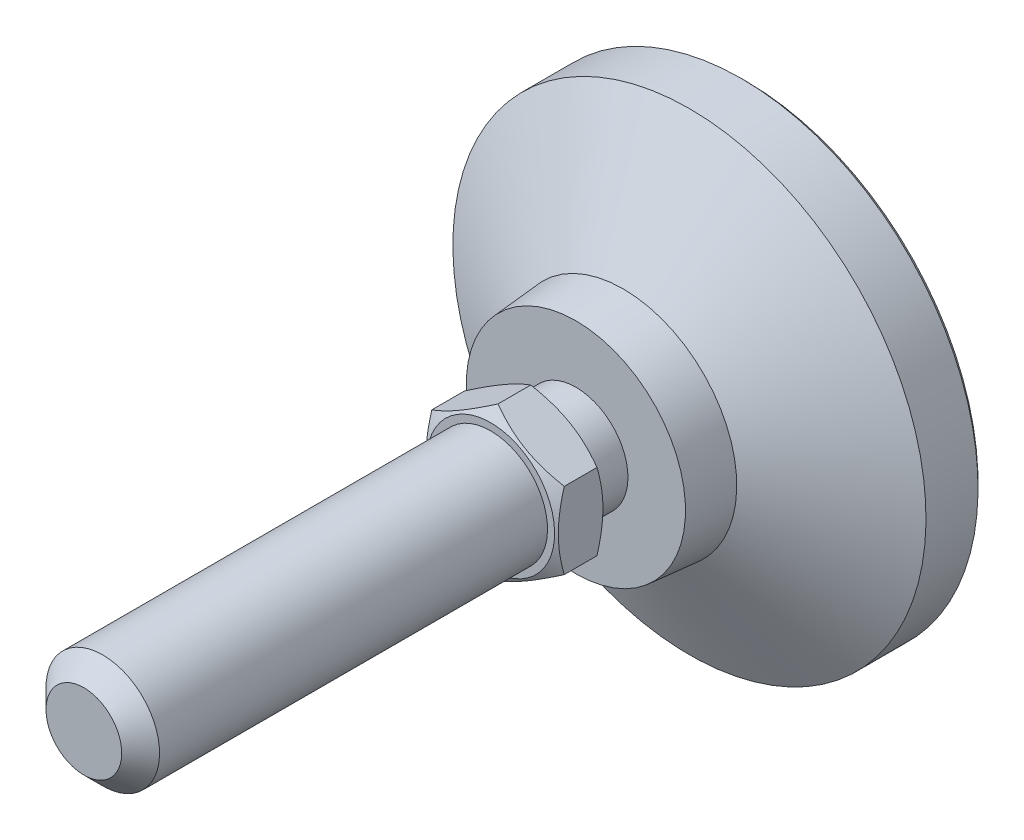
ISO-10303-21;
HEADER;
FILE_DESCRIPTION(('STEP AP214'),'2;1');
FILE_NAME('part.step','',(''),(''),'','','');
FILE_SCHEMA(('AUTOMOTIVE_DESIGN { 1 0 10303 214 1 1 1 1 }'));
ENDSEC;
DATA;
#1=APPLICATION_CONTEXT('core data for automotive mechanical design processes');
#2=APPLICATION_PROTOCOL_DEFINITION('international standard','automotive_design',2000,#1);
#3=PRODUCT_CONTEXT('',#1,'mechanical');
#4=PRODUCT('Part','Part','',(#3));
#5=PRODUCT_RELATED_PRODUCT_CATEGORY('part','',(#4));
#6=PRODUCT_DEFINITION_FORMATION('','',#4);
#7=PRODUCT_DEFINITION_CONTEXT('part definition',#1,'design');
#8=PRODUCT_DEFINITION('design','',#6,#7);
#9=PRODUCT_DEFINITION_SHAPE('','',#8);
#10=(LENGTH_UNIT() NAMED_UNIT(*) SI_UNIT(.MILLI.,.METRE.));
#11=(NAMED_UNIT(*) PLANE_ANGLE_UNIT() SI_UNIT($,.RADIAN.));
#12=(NAMED_UNIT(*) SI_UNIT($,.STERADIAN.) SOLID_ANGLE_UNIT());
#13=UNCERTAINTY_MEASURE_WITH_UNIT(LENGTH_MEASURE(1.E-05),#10,'distance_accuracy_value','');
#14=(GEOMETRIC_REPRESENTATION_CONTEXT(3) GLOBAL_UNCERTAINTY_ASSIGNED_CONTEXT((#13)) GLOBAL_UNIT_ASSIGNED_CONTEXT((#10,
#11,#12)) REPRESENTATION_CONTEXT('',''));
#15=CARTESIAN_POINT('',(0.,0.,0.));
#16=DIRECTION('',(0.,0.,1.));
#17=DIRECTION('',(1.,0.,0.));
#18=AXIS2_PLACEMENT_3D('',#15,#16,#17);
#19=CARTESIAN_POINT('',(0.,0.,-1.00000000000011));
#20=DIRECTION('',(0.,0.,-1.));
#21=DIRECTION('',(0.,1.,0.));
#22=AXIS2_PLACEMENT_3D('',#19,#20,#21);
#23=CYLINDRICAL_SURFACE('',#22,5.5);
#24=CARTESIAN_POINT('',(0.,0.,21.9999999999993));
#25=DIRECTION('',(0.,0.,-1.));
#26=DIRECTION('',(0.,1.,0.));
#27=AXIS2_PLACEMENT_3D('',#24,#25,#26);
#28=CIRCLE('',#27,5.5);
#29=CARTESIAN_POINT('',(0.,5.5,21.9999999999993));
#30=VERTEX_POINT('',#29);
#31=EDGE_CURVE('E106',#30,#30,#28,.T.);
#32=ORIENTED_EDGE('',*,*,#31,.T.);
#33=EDGE_LOOP('',(#32));
#34=FACE_BOUND('',#33,.T.);
#35=CARTESIAN_POINT('',(0.,0.,18.));
#36=DIRECTION('',(0.,0.,-1.));
#37=DIRECTION('',(0.,1.,0.));
#38=AXIS2_PLACEMENT_3D('',#35,#36,#37);
#39=CIRCLE('',#38,5.5);
#40=CARTESIAN_POINT('',(0.,5.5,18.));
#41=VERTEX_POINT('',#40);
#42=EDGE_CURVE('E93',#41,#41,#39,.T.);
#43=ORIENTED_EDGE('',*,*,#42,.F.);
#44=EDGE_LOOP('',(#43));
#45=FACE_BOUND('',#44,.T.);
#46=ADVANCED_FACE('F14',(#34,#45),#23,.T.);
#47=CARTESIAN_POINT('',(-5.5,0.,21.9999999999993));
#48=DIRECTION('',(0.,0.,1.));
#49=DIRECTION('',(0.,-1.,0.));
#50=AXIS2_PLACEMENT_3D('',#47,#48,#49);
#51=PLANE('',#50);
#52=CARTESIAN_POINT('',(0.,0.,21.9999999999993));
#53=DIRECTION('',(0.,0.,1.));
#54=DIRECTION('',(0.,-1.,0.));
#55=AXIS2_PLACEMENT_3D('',#52,#53,#54);
#56=CIRCLE('',#55,6.75);
#57=CARTESIAN_POINT('',(0.,-6.75,21.9999999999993));
#58=VERTEX_POINT('',#57);
#59=EDGE_CURVE('E416',#58,#58,#56,.T.);
#60=ORIENTED_EDGE('',*,*,#59,.F.);
#61=EDGE_LOOP('',(#60));
#62=FACE_BOUND('',#61,.T.);
#63=ORIENTED_EDGE('',*,*,#31,.F.);
#64=EDGE_LOOP('',(#63));
#65=FACE_BOUND('',#64,.T.);
#66=ADVANCED_FACE('F139',(#62,#65),#51,.F.);
#67=CARTESIAN_POINT('',(0.,-5.5,18.));
#68=DIRECTION('',(0.,0.,1.));
#69=DIRECTION('',(0.,-1.,0.));
#70=AXIS2_PLACEMENT_3D('',#67,#68,#69);
#71=PLANE('',#70);
#72=ORIENTED_EDGE('',*,*,#42,.T.);
#73=EDGE_LOOP('',(#72));
#74=FACE_BOUND('',#73,.T.);
#75=CARTESIAN_POINT('',(0.,0.,18.));
#76=DIRECTION('',(0.,0.,1.));
#77=DIRECTION('',(0.,-1.,0.));
#78=AXIS2_PLACEMENT_3D('',#75,#76,#77);
#79=CIRCLE('',#78,11.5833333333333);
#80=CARTESIAN_POINT('',(0.,-11.5833333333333,18.));
#81=VERTEX_POINT('',#80);
#82=EDGE_CURVE('E88',#81,#81,#79,.T.);
#83=ORIENTED_EDGE('',*,*,#82,.T.);
#84=EDGE_LOOP('',(#83));
#85=FACE_BOUND('',#84,.T.);
#86=ADVANCED_FACE('F130',(#74,#85),#71,.T.);
#87=CARTESIAN_POINT('',(0.,0.,0.));
#88=DIRECTION('',(0.,0.,-1.));
#89=DIRECTION('',(0.,1.,0.));
#90=AXIS2_PLACEMENT_3D('',#87,#88,#89);
#91=PLANE('',#90);
#92=CARTESIAN_POINT('',(0.,0.,0.));
#93=DIRECTION('',(0.,0.,-1.));
#94=DIRECTION('',(0.,1.,0.));
#95=AXIS2_PLACEMENT_3D('',#92,#93,#94);
#96=CIRCLE('',#95,24.5);
#97=CARTESIAN_POINT('',(0.,24.5,0.));
#98=VERTEX_POINT('',#97);
#99=EDGE_CURVE('E114',#98,#98,#96,.T.);
#100=ORIENTED_EDGE('',*,*,#99,.T.);
#101=EDGE_LOOP('',(#100));
#102=FACE_BOUND('',#101,.T.);
#103=ADVANCED_FACE('F128',(#102),#91,.T.);
#104=CARTESIAN_POINT('',(0.,0.,-1.00000000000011));
#105=DIRECTION('',(0.,0.,-1.));
#106=DIRECTION('',(0.,1.,0.));
#107=AXIS2_PLACEMENT_3D('',#104,#105,#106);
#108=CYLINDRICAL_SURFACE('',#107,25.);
#109=CARTESIAN_POINT('',(0.,0.,0.500000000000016));
#110=DIRECTION('',(0.,0.,-1.));
#111=DIRECTION('',(0.,1.,0.));
#112=AXIS2_PLACEMENT_3D('',#109,#110,#111);
#113=CIRCLE('',#112,25.);
#114=CARTESIAN_POINT('',(0.,25.,0.500000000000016));
#115=VERTEX_POINT('',#114);
#116=EDGE_CURVE('E28',#115,#115,#113,.F.);
#117=ORIENTED_EDGE('',*,*,#116,.T.);
#118=EDGE_LOOP('',(#117));
#119=FACE_BOUND('',#118,.T.);
#120=CARTESIAN_POINT('',(0.,0.,6.));
#121=DIRECTION('',(0.,0.,-1.));
#122=DIRECTION('',(0.,1.,0.));
#123=AXIS2_PLACEMENT_3D('',#120,#121,#122);
#124=CIRCLE('',#123,25.);
#125=CARTESIAN_POINT('',(0.,25.,6.));
#126=VERTEX_POINT('',#125);
#127=EDGE_CURVE('E112',#126,#126,#124,.T.);
#128=ORIENTED_EDGE('',*,*,#127,.T.);
#129=EDGE_LOOP('',(#128));
#130=FACE_BOUND('',#129,.T.);
#131=ADVANCED_FACE('F120',(#119,#130),#108,.T.);
#132=CARTESIAN_POINT('',(0.,0.,13.));
#133=DIRECTION('',(0.,0.,-1.));
#134=DIRECTION('',(0.,1.,0.));
#135=AXIS2_PLACEMENT_3D('',#132,#133,#134);
#136=CONICAL_SURFACE('',#135,11.9999999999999,1.07685495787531);
#137=ORIENTED_EDGE('',*,*,#127,.F.);
#138=EDGE_LOOP('',(#137));
#139=FACE_BOUND('',#138,.T.);
#140=CARTESIAN_POINT('',(0.,0.,13.));
#141=DIRECTION('',(0.,0.,-1.));
#142=DIRECTION('',(0.,1.,0.));
#143=AXIS2_PLACEMENT_3D('',#140,#141,#142);
#144=CIRCLE('',#143,11.9999999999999);
#145=CARTESIAN_POINT('',(0.,11.9999999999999,13.));
#146=VERTEX_POINT('',#145);
#147=EDGE_CURVE('E109',#146,#146,#144,.T.);
#148=ORIENTED_EDGE('',*,*,#147,.T.);
#149=EDGE_LOOP('',(#148));
#150=FACE_BOUND('',#149,.T.);
#151=ADVANCED_FACE('F138',(#139,#150),#136,.T.);
#152=CARTESIAN_POINT('',(0.,0.,19.));
#153=DIRECTION('',(0.,0.,-1.));
#154=DIRECTION('',(0.,1.,0.));
#155=AXIS2_PLACEMENT_3D('',#152,#153,#154);
#156=CONICAL_SURFACE('',#155,11.5,0.0831412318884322);
#157=ORIENTED_EDGE('',*,*,#147,.F.);
#158=EDGE_LOOP('',(#157));
#159=FACE_BOUND('',#158,.T.);
#160=ORIENTED_EDGE('',*,*,#82,.F.);
#161=EDGE_LOOP('',(#160));
#162=FACE_BOUND('',#161,.T.);
#163=ADVANCED_FACE('F125',(#159,#162),#156,.T.);
#164=CARTESIAN_POINT('',(0.,0.,0.));
#165=DIRECTION('',(0.,0.,1.));
#166=DIRECTION('',(0.,-1.,0.));
#167=AXIS2_PLACEMENT_3D('',#164,#165,#166);
#168=CONICAL_SURFACE('',#167,24.5,0.785398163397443);
#169=ORIENTED_EDGE('',*,*,#116,.F.);
#170=EDGE_LOOP('',(#169));
#171=FACE_BOUND('',#170,.T.);
#172=ORIENTED_EDGE('',*,*,#99,.F.);
#173=EDGE_LOOP('',(#172));
#174=FACE_BOUND('',#173,.T.);
#175=ADVANCED_FACE('F16',(#171,#174),#168,.T.);
#176=CARTESIAN_POINT('',(0.,0.,21.9999999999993));
#177=DIRECTION('',(0.,0.,1.));
#178=DIRECTION('',(0.,-1.,0.));
#179=AXIS2_PLACEMENT_3D('',#176,#177,#178);
#180=CONICAL_SURFACE('',#179,6.75,1.0471975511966);
#181=CARTESIAN_POINT('',(0.000200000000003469,-8.0830192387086,22.7696190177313));
#182=CARTESIAN_POINT('',(-0.15366790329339,-7.99418356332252,22.7183374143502));
#183=CARTESIAN_POINT('',(-0.308109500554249,-7.90501666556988,22.6693831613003));
#184=CARTESIAN_POINT('',(-0.618246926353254,-7.72595873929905,22.5767703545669));
#185=CARTESIAN_POINT('',(-0.773943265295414,-7.63606741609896,22.5331140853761));
#186=CARTESIAN_POINT('',(-1.24352516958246,-7.36495417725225,22.4109491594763));
#187=CARTESIAN_POINT('',(-1.5592643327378,-7.18266208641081,22.3414631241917));
#188=CARTESIAN_POINT('',(-2.03176224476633,-6.90986528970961,22.2599825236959));
#189=CARTESIAN_POINT('',(-2.18710922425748,-6.82017566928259,22.2367710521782));
#190=CARTESIAN_POINT('',(-2.49850511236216,-6.64039116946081,22.1978487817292));
#191=CARTESIAN_POINT('',(-2.65455395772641,-6.55029632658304,22.1821373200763));
#192=CARTESIAN_POINT('',(-2.96692267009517,-6.36995016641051,22.1586154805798));
#193=CARTESIAN_POINT('',(-3.12324202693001,-6.27969914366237,22.1507961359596));
#194=CARTESIAN_POINT('',(-3.43601650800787,-6.09911871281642,22.1432178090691));
#195=CARTESIAN_POINT('',(-3.59247162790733,-6.00878930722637,22.1434585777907));
#196=CARTESIAN_POINT('',(-4.02110687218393,-5.76131663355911,22.1551972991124));
#197=CARTESIAN_POINT('',(-4.2931466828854,-5.60425437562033,22.1749033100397));
#198=CARTESIAN_POINT('',(-4.83541944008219,-5.29117305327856,22.2373910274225));
#199=CARTESIAN_POINT('',(-5.10565047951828,-5.13515508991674,22.2801940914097));
#200=CARTESIAN_POINT('',(-5.64901454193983,-4.82144370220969,22.3871892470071));
#201=CARTESIAN_POINT('',(-5.92207900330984,-4.6637898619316,22.4518346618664));
#202=CARTESIAN_POINT('',(-6.46413578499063,-4.35083323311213,22.5985536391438));
#203=CARTESIAN_POINT('',(-6.73313504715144,-4.19552643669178,22.6805927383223));
#204=CARTESIAN_POINT('',(-7.0002,-4.04133641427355,22.7696190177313));
#205=B_SPLINE_CURVE_WITH_KNOTS('',3,(#181,#182,#183,#184,#185,#186,#187,#188,#189,#190,#191,
#192,#193,#194,#195,#196,#197,#198,#199,#200,#201,#202,#203,#204),.UNSPECIFIED.,.F.,.F.,(4,2,2,
2,2,2,2,2,2,2,2,4),(0.,0.554727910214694,1.10969417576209,2.2219327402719,2.76443041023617,
3.30688013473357,3.8487128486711,4.39052882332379,5.33376515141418,6.27787517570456,
7.24292418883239,8.20607866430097),.UNSPECIFIED.);
#206=CARTESIAN_POINT('',(0.,-8.08290376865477,22.769552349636));
#207=VERTEX_POINT('',#206);
#208=CARTESIAN_POINT('',(-7.,-4.04145188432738,22.769552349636));
#209=VERTEX_POINT('',#208);
#210=EDGE_CURVE('E73',#207,#209,#205,.T.);
#211=ORIENTED_EDGE('',*,*,#210,.T.);
#212=CARTESIAN_POINT('',(-7.,10.8318947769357,25.5489124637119));
#213=CARTESIAN_POINT('',(-7.,10.5263577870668,25.4007960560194));
#214=CARTESIAN_POINT('',(-7.,10.2201168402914,25.2541067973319));
#215=CARTESIAN_POINT('',(-7.,9.60585256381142,24.9643857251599));
#216=CARTESIAN_POINT('',(-7.,9.29782896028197,24.8213544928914));
#217=CARTESIAN_POINT('',(-7.,8.67802637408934,24.5390279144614));
#218=CARTESIAN_POINT('',(-7.,8.36623606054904,24.3997573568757));
#219=CARTESIAN_POINT('',(-7.,7.74016720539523,24.126947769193));
#220=CARTESIAN_POINT('',(-7.,7.42588878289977,23.9934084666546));
#221=CARTESIAN_POINT('',(-7.,6.7842938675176,23.7294406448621));
#222=CARTESIAN_POINT('',(-7.,6.45688057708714,23.599246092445));
#223=CARTESIAN_POINT('',(-7.,5.79821544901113,23.3487686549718));
#224=CARTESIAN_POINT('',(-7.,5.4669631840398,23.228486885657));
#225=CARTESIAN_POINT('',(-7.,4.80071686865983,23.0010105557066));
#226=CARTESIAN_POINT('',(-7.,4.46573203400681,22.8937892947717));
#227=CARTESIAN_POINT('',(-7.,3.79096943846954,22.6958888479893));
#228=CARTESIAN_POINT('',(-7.,3.45119323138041,22.605204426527));
#229=CARTESIAN_POINT('',(-7.,2.76847868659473,22.4452322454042));
#230=CARTESIAN_POINT('',(-7.,2.42556806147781,22.375829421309));
#231=CARTESIAN_POINT('',(-7.,1.90809870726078,22.290703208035));
#232=CARTESIAN_POINT('',(-7.,1.73507880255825,22.265489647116));
#233=CARTESIAN_POINT('',(-7.,1.38818715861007,22.2218836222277));
#234=CARTESIAN_POINT('',(-7.,1.21431550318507,22.2034905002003));
#235=CARTESIAN_POINT('',(-7.,0.868214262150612,22.1741212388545));
#236=CARTESIAN_POINT('',(-7.,0.695992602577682,22.1630520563));
#237=CARTESIAN_POINT('',(-7.,0.35123564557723,22.1482048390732));
#238=CARTESIAN_POINT('',(-7.,0.178700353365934,22.1444266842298));
#239=CARTESIAN_POINT('',(-7.,-0.166375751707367,22.1442515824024));
#240=CARTESIAN_POINT('',(-7.,-0.338916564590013,22.147854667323));
#241=CARTESIAN_POINT('',(-7.,-0.683693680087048,22.1623544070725));
#242=CARTESIAN_POINT('',(-7.,-0.855929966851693,22.1732514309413));
#243=CARTESIAN_POINT('',(-7.,-1.27059309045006,22.2080368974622));
#244=CARTESIAN_POINT('',(-7.,-1.51273234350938,22.2354264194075));
#245=CARTESIAN_POINT('',(-7.,-1.99518655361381,22.3031214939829));
#246=CARTESIAN_POINT('',(-7.,-2.23550125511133,22.3434288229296));
#247=CARTESIAN_POINT('',(-7.,-2.95344894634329,22.4815878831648));
#248=CARTESIAN_POINT('',(-7.,-3.42781219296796,22.596650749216));
#249=CARTESIAN_POINT('',(-7.,-4.13708226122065,22.7958408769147));
#250=CARTESIAN_POINT('',(-7.,-4.37567652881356,22.867590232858));
#251=CARTESIAN_POINT('',(-7.,-4.85054706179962,23.0184566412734));
#252=CARTESIAN_POINT('',(-7.,-5.08682331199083,23.0975737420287));
#253=CARTESIAN_POINT('',(-7.,-5.55713378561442,23.2619132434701));
#254=CARTESIAN_POINT('',(-7.,-5.79116873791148,23.3471335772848));
#255=CARTESIAN_POINT('',(-7.,-6.25730525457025,23.5226852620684));
#256=CARTESIAN_POINT('',(-7.,-6.48940684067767,23.613016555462));
#257=CARTESIAN_POINT('',(-7.,-7.03351444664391,23.8305763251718));
#258=CARTESIAN_POINT('',(-7.,-7.34481113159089,23.959575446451));
#259=CARTESIAN_POINT('',(-7.,-7.96478974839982,24.2237287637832));
#260=CARTESIAN_POINT('',(-7.,-8.27347152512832,24.3588833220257));
#261=CARTESIAN_POINT('',(-7.,-8.88869656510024,24.6341214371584));
#262=CARTESIAN_POINT('',(-7.,-9.19523939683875,24.7742059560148));
#263=CARTESIAN_POINT('',(-7.,-9.80649195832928,25.0583257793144));
#264=CARTESIAN_POINT('',(-7.,-10.111201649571,25.2023611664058));
#265=CARTESIAN_POINT('',(-7.,-10.7193973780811,25.4937961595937));
#266=CARTESIAN_POINT('',(-7.,-11.0228818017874,25.6411991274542));
#267=CARTESIAN_POINT('',(-7.,-11.6285498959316,25.9386560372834));
#268=CARTESIAN_POINT('',(-7.,-11.9307335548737,26.0887100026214));
#269=CARTESIAN_POINT('',(-7.,-12.8355637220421,26.5421094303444));
#270=CARTESIAN_POINT('',(-7.,-13.4365686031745,26.8487306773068));
#271=CARTESIAN_POINT('',(-7.,-14.5856970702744,27.4424566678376));
#272=CARTESIAN_POINT('',(-7.,-15.1340744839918,27.7290723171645));
#273=CARTESIAN_POINT('',(-7.,-16.2287892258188,28.3062159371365));
#274=CARTESIAN_POINT('',(-7.,-16.7751264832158,28.5967440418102));
#275=CARTESIAN_POINT('',(-7.,-17.8648736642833,29.1800697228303));
#276=CARTESIAN_POINT('',(-7.,-18.4082874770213,29.47286004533));
#277=CARTESIAN_POINT('',(-7.,-19.4938087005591,30.0607837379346));
#278=CARTESIAN_POINT('',(-7.,-20.0359161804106,30.3559169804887));
#279=CARTESIAN_POINT('',(-7.,-20.5775418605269,30.6519258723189));
#280=B_SPLINE_CURVE_WITH_KNOTS('',3,(#212,#213,#214,#215,#216,#217,#218,#219,#220,#221,#222,
#223,#224,#225,#226,#227,#228,#229,#230,#231,#232,#233,#234,#235,#236,#237,#238,#239,#240,#241,
#242,#243,#244,#245,#246,#247,#248,#249,#250,#251,#252,#253,#254,#255,#256,#257,#258,#259,#260,
#261,#262,#263,#264,#265,#266,#267,#268,#269,#270,#271,#272,#273,#274,#275,#276,#277,#278,#279),
.UNSPECIFIED.,.F.,.F.,(4,2,2,2,2,2,2,2,2,2,2,2,2,2,2,2,2,2,2,2,2,2,2,2,2,2,2,2,2,2,2,2,2,4),(0.,
1.01864982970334,2.03746051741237,3.06185825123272,4.08620723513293,5.14313083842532,
6.20017324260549,7.25501705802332,8.30952632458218,9.35822927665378,9.8826581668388,
10.4070364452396,10.9246181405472,11.4421913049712,11.959766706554,12.4773682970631,
13.2080051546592,13.938742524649,15.4010372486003,16.1484227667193,16.8958131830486,
17.642951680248,18.3900817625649,19.4008922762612,20.4117623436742,21.4228307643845,
22.4339203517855,23.4460676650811,24.4582239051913,26.4822725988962,28.3385415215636,
30.1948741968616,32.0466841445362,33.8983939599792),.UNSPECIFIED.);
#281=CARTESIAN_POINT('',(-7.,4.04145188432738,22.769552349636));
#282=VERTEX_POINT('',#281);
#283=EDGE_CURVE('E81',#209,#282,#280,.F.);
#284=ORIENTED_EDGE('',*,*,#283,.T.);
#285=CARTESIAN_POINT('',(-7.0002,4.04133641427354,22.7696190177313));
#286=CARTESIAN_POINT('',(-6.84633209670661,4.13017208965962,22.7183374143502));
#287=CARTESIAN_POINT('',(-6.69189049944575,4.21933898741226,22.6693831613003));
#288=CARTESIAN_POINT('',(-6.38175307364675,4.39839691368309,22.5767703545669));
#289=CARTESIAN_POINT('',(-6.22605673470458,4.48828823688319,22.5331140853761));
#290=CARTESIAN_POINT('',(-5.75647483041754,4.75940147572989,22.4109491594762));
#291=CARTESIAN_POINT('',(-5.4407356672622,4.94169356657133,22.3414631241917));
#292=CARTESIAN_POINT('',(-4.96823775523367,5.21449036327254,22.2599825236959));
#293=CARTESIAN_POINT('',(-4.81289077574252,5.30417998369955,22.2367710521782));
#294=CARTESIAN_POINT('',(-4.50149488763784,5.48396448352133,22.1978487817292));
#295=CARTESIAN_POINT('',(-4.34544604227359,5.57405932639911,22.1821373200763));
#296=CARTESIAN_POINT('',(-4.03307732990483,5.75440548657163,22.1586154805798));
#297=CARTESIAN_POINT('',(-3.87675797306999,5.84465650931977,22.1507961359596));
#298=CARTESIAN_POINT('',(-3.56398349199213,6.02523694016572,22.1432178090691));
#299=CARTESIAN_POINT('',(-3.40752837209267,6.11556634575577,22.1434585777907));
#300=CARTESIAN_POINT('',(-2.97889312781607,6.36303901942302,22.1551972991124));
#301=CARTESIAN_POINT('',(-2.7068533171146,6.52010127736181,22.1749033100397));
#302=CARTESIAN_POINT('',(-2.16458055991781,6.83318259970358,22.2373910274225));
#303=CARTESIAN_POINT('',(-1.89434952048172,6.9892005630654,22.2801940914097));
#304=CARTESIAN_POINT('',(-1.35098545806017,7.30291195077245,22.3871892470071));
#305=CARTESIAN_POINT('',(-1.07792099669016,7.46056579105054,22.4518346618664));
#306=CARTESIAN_POINT('',(-0.535864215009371,7.77352241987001,22.5985536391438));
#307=CARTESIAN_POINT('',(-0.26686495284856,7.92882921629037,22.6805927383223));
#308=CARTESIAN_POINT('',(0.000199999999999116,8.0830192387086,22.7696190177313));
#309=B_SPLINE_CURVE_WITH_KNOTS('',3,(#285,#286,#287,#288,#289,#290,#291,#292,#293,#294,#295,
#296,#297,#298,#299,#300,#301,#302,#303,#304,#305,#306,#307,#308),.UNSPECIFIED.,.F.,.F.,(4,2,2,
2,2,2,2,2,2,2,2,4),(0.,0.554727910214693,1.10969417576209,2.2219327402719,2.76443041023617,
3.30688013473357,3.84871284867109,4.39052882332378,5.33376515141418,6.27787517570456,
7.2429241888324,8.20607866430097),.UNSPECIFIED.);
#310=CARTESIAN_POINT('',(0.,8.08290376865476,22.769552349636));
#311=VERTEX_POINT('',#310);
#312=EDGE_CURVE('E367',#282,#311,#309,.T.);
#313=ORIENTED_EDGE('',*,*,#312,.T.);
#314=CARTESIAN_POINT('',(-0.000200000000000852,8.0830192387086,22.7696190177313));
#315=CARTESIAN_POINT('',(0.153667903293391,7.99418356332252,22.7183374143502));
#316=CARTESIAN_POINT('',(0.308109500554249,7.90501666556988,22.6693831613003));
#317=CARTESIAN_POINT('',(0.618246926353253,7.72595873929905,22.5767703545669));
#318=CARTESIAN_POINT('',(0.773943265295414,7.63606741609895,22.5331140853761));
#319=CARTESIAN_POINT('',(1.24352516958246,7.36495417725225,22.4109491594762));
#320=CARTESIAN_POINT('',(1.5592643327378,7.18266208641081,22.3414631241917));
#321=CARTESIAN_POINT('',(2.03176224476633,6.9098652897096,22.2599825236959));
#322=CARTESIAN_POINT('',(2.18710922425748,6.82017566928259,22.2367710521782));
#323=CARTESIAN_POINT('',(2.49850511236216,6.64039116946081,22.1978487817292));
#324=CARTESIAN_POINT('',(2.6545539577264,6.55029632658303,22.1821373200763));
#325=CARTESIAN_POINT('',(2.96692267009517,6.36995016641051,22.1586154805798));
#326=CARTESIAN_POINT('',(3.12324202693,6.27969914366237,22.1507961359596));
#327=CARTESIAN_POINT('',(3.43601650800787,6.09911871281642,22.1432178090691));
#328=CARTESIAN_POINT('',(3.59247162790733,6.00878930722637,22.1434585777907));
#329=CARTESIAN_POINT('',(4.02110687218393,5.76131663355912,22.1551972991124));
#330=CARTESIAN_POINT('',(4.2931466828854,5.60425437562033,22.1749033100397));
#331=CARTESIAN_POINT('',(4.83541944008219,5.29117305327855,22.2373910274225));
#332=CARTESIAN_POINT('',(5.10565047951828,5.13515508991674,22.2801940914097));
#333=CARTESIAN_POINT('',(5.64901454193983,4.82144370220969,22.3871892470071));
#334=CARTESIAN_POINT('',(5.92207900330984,4.66378986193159,22.4518346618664));
#335=CARTESIAN_POINT('',(6.46413578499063,4.35083323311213,22.5985536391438));
#336=CARTESIAN_POINT('',(6.73313504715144,4.19552643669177,22.6805927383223));
#337=CARTESIAN_POINT('',(7.0002,4.04133641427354,22.7696190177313));
#338=B_SPLINE_CURVE_WITH_KNOTS('',3,(#314,#315,#316,#317,#318,#319,#320,#321,#322,#323,#324,
#325,#326,#327,#328,#329,#330,#331,#332,#333,#334,#335,#336,#337),.UNSPECIFIED.,.F.,.F.,(4,2,2,
2,2,2,2,2,2,2,2,4),(0.,0.554727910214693,1.10969417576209,2.2219327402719,2.76443041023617,
3.30688013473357,3.8487128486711,4.39052882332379,5.33376515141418,6.27787517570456,
7.2429241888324,8.20607866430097),.UNSPECIFIED.);
#339=CARTESIAN_POINT('',(7.,4.04145188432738,22.769552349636));
#340=VERTEX_POINT('',#339);
#341=EDGE_CURVE('E362',#311,#340,#338,.T.);
#342=ORIENTED_EDGE('',*,*,#341,.T.);
#343=CARTESIAN_POINT('',(7.,10.8318947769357,25.5489124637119));
#344=CARTESIAN_POINT('',(7.,10.5263577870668,25.4007960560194));
#345=CARTESIAN_POINT('',(7.,10.2201168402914,25.2541067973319));
#346=CARTESIAN_POINT('',(7.,9.60585256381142,24.9643857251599));
#347=CARTESIAN_POINT('',(7.,9.29782896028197,24.8213544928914));
#348=CARTESIAN_POINT('',(7.,8.67802637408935,24.5390279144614));
#349=CARTESIAN_POINT('',(7.,8.36623606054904,24.3997573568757));
#350=CARTESIAN_POINT('',(7.,7.74016720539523,24.126947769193));
#351=CARTESIAN_POINT('',(7.,7.42588878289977,23.9934084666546));
#352=CARTESIAN_POINT('',(7.,6.7842938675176,23.7294406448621));
#353=CARTESIAN_POINT('',(7.,6.45688057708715,23.599246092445));
#354=CARTESIAN_POINT('',(7.,5.79821544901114,23.3487686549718));
#355=CARTESIAN_POINT('',(7.,5.46696318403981,23.228486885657));
#356=CARTESIAN_POINT('',(7.,4.80071686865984,23.0010105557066));
#357=CARTESIAN_POINT('',(7.,4.46573203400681,22.8937892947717));
#358=CARTESIAN_POINT('',(7.,3.79096943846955,22.6958888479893));
#359=CARTESIAN_POINT('',(7.,3.45119323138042,22.605204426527));
#360=CARTESIAN_POINT('',(7.,2.76847868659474,22.4452322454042));
#361=CARTESIAN_POINT('',(7.,2.42556806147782,22.375829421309));
#362=CARTESIAN_POINT('',(7.,1.90809870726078,22.290703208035));
#363=CARTESIAN_POINT('',(7.,1.73507880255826,22.265489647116));
#364=CARTESIAN_POINT('',(7.,1.38818715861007,22.2218836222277));
#365=CARTESIAN_POINT('',(7.,1.21431550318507,22.2034905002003));
#366=CARTESIAN_POINT('',(7.,0.868214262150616,22.1741212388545));
#367=CARTESIAN_POINT('',(7.,0.695992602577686,22.1630520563));
#368=CARTESIAN_POINT('',(7.,0.351235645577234,22.1482048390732));
#369=CARTESIAN_POINT('',(7.,0.178700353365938,22.1444266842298));
#370=CARTESIAN_POINT('',(7.,-0.166375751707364,22.1442515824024));
#371=CARTESIAN_POINT('',(7.,-0.33891656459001,22.147854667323));
#372=CARTESIAN_POINT('',(7.,-0.683693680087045,22.1623544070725));
#373=CARTESIAN_POINT('',(7.,-0.855929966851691,22.1732514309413));
#374=CARTESIAN_POINT('',(7.,-1.27059309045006,22.2080368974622));
#375=CARTESIAN_POINT('',(7.,-1.51273234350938,22.2354264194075));
#376=CARTESIAN_POINT('',(7.,-1.99518655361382,22.3031214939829));
#377=CARTESIAN_POINT('',(7.,-2.23550125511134,22.3434288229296));
#378=CARTESIAN_POINT('',(7.,-2.95344894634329,22.4815878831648));
#379=CARTESIAN_POINT('',(7.,-3.42781219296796,22.596650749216));
#380=CARTESIAN_POINT('',(7.,-4.13708226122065,22.7958408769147));
#381=CARTESIAN_POINT('',(7.,-4.37567652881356,22.867590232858));
#382=CARTESIAN_POINT('',(7.,-4.85054706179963,23.0184566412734));
#383=CARTESIAN_POINT('',(7.,-5.08682331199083,23.0975737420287));
#384=CARTESIAN_POINT('',(7.,-5.55713378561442,23.2619132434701));
#385=CARTESIAN_POINT('',(7.,-5.79116873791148,23.3471335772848));
#386=CARTESIAN_POINT('',(7.,-6.25730525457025,23.5226852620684));
#387=CARTESIAN_POINT('',(7.,-6.48940684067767,23.613016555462));
#388=CARTESIAN_POINT('',(7.,-7.03351444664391,23.8305763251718));
#389=CARTESIAN_POINT('',(7.,-7.34481113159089,23.959575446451));
#390=CARTESIAN_POINT('',(7.,-7.96478974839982,24.2237287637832));
#391=CARTESIAN_POINT('',(7.,-8.27347152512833,24.3588833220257));
#392=CARTESIAN_POINT('',(7.,-8.88869656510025,24.6341214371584));
#393=CARTESIAN_POINT('',(7.,-9.19523939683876,24.7742059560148));
#394=CARTESIAN_POINT('',(7.,-9.80649195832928,25.0583257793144));
#395=CARTESIAN_POINT('',(7.,-10.111201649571,25.2023611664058));
#396=CARTESIAN_POINT('',(7.,-10.7193973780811,25.4937961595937));
#397=CARTESIAN_POINT('',(7.,-11.0228818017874,25.6411991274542));
#398=CARTESIAN_POINT('',(7.,-11.6285498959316,25.9386560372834));
#399=CARTESIAN_POINT('',(7.,-11.9307335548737,26.0887100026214));
#400=CARTESIAN_POINT('',(7.,-12.8355637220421,26.5421094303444));
#401=CARTESIAN_POINT('',(7.,-13.4365686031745,26.8487306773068));
#402=CARTESIAN_POINT('',(7.,-14.5856970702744,27.4424566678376));
#403=CARTESIAN_POINT('',(7.,-15.1340744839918,27.7290723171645));
#404=CARTESIAN_POINT('',(7.,-16.2287892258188,28.3062159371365));
#405=CARTESIAN_POINT('',(7.,-16.7751264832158,28.5967440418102));
#406=CARTESIAN_POINT('',(7.,-17.8648736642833,29.1800697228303));
#407=CARTESIAN_POINT('',(7.,-18.4082874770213,29.47286004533));
#408=CARTESIAN_POINT('',(7.,-19.4938087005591,30.0607837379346));
#409=CARTESIAN_POINT('',(7.,-20.0359161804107,30.3559169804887));
#410=CARTESIAN_POINT('',(7.,-20.5775418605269,30.6519258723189));
#411=B_SPLINE_CURVE_WITH_KNOTS('',3,(#343,#344,#345,#346,#347,#348,#349,#350,#351,#352,#353,
#354,#355,#356,#357,#358,#359,#360,#361,#362,#363,#364,#365,#366,#367,#368,#369,#370,#371,#372,
#373,#374,#375,#376,#377,#378,#379,#380,#381,#382,#383,#384,#385,#386,#387,#388,#389,#390,#391,
#392,#393,#394,#395,#396,#397,#398,#399,#400,#401,#402,#403,#404,#405,#406,#407,#408,#409,#410),
.UNSPECIFIED.,.F.,.F.,(4,2,2,2,2,2,2,2,2,2,2,2,2,2,2,2,2,2,2,2,2,2,2,2,2,2,2,2,2,2,2,2,2,4),(0.,
1.01864982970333,2.03746051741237,3.06185825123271,4.08620723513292,5.14313083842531,
6.20017324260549,7.25501705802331,8.30952632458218,9.35822927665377,9.8826581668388,
10.4070364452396,10.9246181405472,11.4421913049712,11.959766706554,12.4773682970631,
13.2080051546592,13.938742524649,15.4010372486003,16.1484227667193,16.8958131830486,
17.642951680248,18.3900817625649,19.4008922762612,20.4117623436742,21.4228307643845,
22.4339203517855,23.4460676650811,24.4582239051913,26.4822725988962,28.3385415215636,
30.1948741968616,32.0466841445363,33.8983939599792),.UNSPECIFIED.);
#412=CARTESIAN_POINT('',(7.,-4.04145188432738,22.769552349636));
#413=VERTEX_POINT('',#412);
#414=EDGE_CURVE('E34',#340,#413,#411,.T.);
#415=ORIENTED_EDGE('',*,*,#414,.T.);
#416=CARTESIAN_POINT('',(7.0002,-4.04133641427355,22.7696190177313));
#417=CARTESIAN_POINT('',(6.84633209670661,-4.13017208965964,22.7183374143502));
#418=CARTESIAN_POINT('',(6.69189049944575,-4.21933898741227,22.6693831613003));
#419=CARTESIAN_POINT('',(6.38175307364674,-4.3983969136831,22.5767703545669));
#420=CARTESIAN_POINT('',(6.22605673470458,-4.4882882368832,22.5331140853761));
#421=CARTESIAN_POINT('',(5.75647483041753,-4.7594014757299,22.4109491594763));
#422=CARTESIAN_POINT('',(5.4407356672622,-4.94169356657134,22.3414631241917));
#423=CARTESIAN_POINT('',(4.96823775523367,-5.21449036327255,22.2599825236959));
#424=CARTESIAN_POINT('',(4.81289077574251,-5.30417998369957,22.2367710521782));
#425=CARTESIAN_POINT('',(4.50149488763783,-5.48396448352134,22.1978487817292));
#426=CARTESIAN_POINT('',(4.34544604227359,-5.57405932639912,22.1821373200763));
#427=CARTESIAN_POINT('',(4.03307732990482,-5.75440548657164,22.1586154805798));
#428=CARTESIAN_POINT('',(3.87675797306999,-5.84465650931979,22.1507961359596));
#429=CARTESIAN_POINT('',(3.56398349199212,-6.02523694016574,22.1432178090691));
#430=CARTESIAN_POINT('',(3.40752837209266,-6.11556634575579,22.1434585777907));
#431=CARTESIAN_POINT('',(2.97889312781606,-6.36303901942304,22.1551972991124));
#432=CARTESIAN_POINT('',(2.7068533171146,-6.52010127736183,22.1749033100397));
#433=CARTESIAN_POINT('',(2.1645805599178,-6.8331825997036,22.2373910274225));
#434=CARTESIAN_POINT('',(1.89434952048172,-6.98920056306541,22.2801940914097));
#435=CARTESIAN_POINT('',(1.35098545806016,-7.30291195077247,22.3871892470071));
#436=CARTESIAN_POINT('',(1.07792099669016,-7.46056579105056,22.4518346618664));
#437=CARTESIAN_POINT('',(0.535864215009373,-7.77352241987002,22.5985536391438));
#438=CARTESIAN_POINT('',(0.266864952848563,-7.92882921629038,22.6805927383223));
#439=CARTESIAN_POINT('',(-0.000199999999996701,-8.08301923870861,22.7696190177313));
#440=B_SPLINE_CURVE_WITH_KNOTS('',3,(#416,#417,#418,#419,#420,#421,#422,#423,#424,#425,#426,
#427,#428,#429,#430,#431,#432,#433,#434,#435,#436,#437,#438,#439),.UNSPECIFIED.,.F.,.F.,(4,2,2,
2,2,2,2,2,2,2,2,4),(0.,0.554727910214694,1.10969417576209,2.2219327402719,2.76443041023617,
3.30688013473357,3.8487128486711,4.39052882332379,5.33376515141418,6.27787517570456,
7.2429241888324,8.20607866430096),.UNSPECIFIED.);
#441=EDGE_CURVE('E9',#413,#207,#440,.T.);
#442=ORIENTED_EDGE('',*,*,#441,.T.);
#443=EDGE_LOOP('',(#211,#284,#313,#342,#415,#442));
#444=FACE_BOUND('',#443,.T.);
#445=ORIENTED_EDGE('',*,*,#59,.T.);
#446=EDGE_LOOP('',(#445));
#447=FACE_BOUND('',#446,.T.);
#448=ADVANCED_FACE('F71',(#444,#447),#180,.T.);
#449=CARTESIAN_POINT('',(-3.9999999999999,0.,70.));
#450=DIRECTION('',(0.,0.,-1.));
#451=DIRECTION('',(0.,1.,0.));
#452=AXIS2_PLACEMENT_3D('',#449,#450,#451);
#453=PLANE('',#452);
#454=CARTESIAN_POINT('',(0.,0.,70.));
#455=DIRECTION('',(0.,0.,-1.));
#456=DIRECTION('',(0.,1.,0.));
#457=AXIS2_PLACEMENT_3D('',#454,#455,#456);
#458=CIRCLE('',#457,3.9999999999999);
#459=CARTESIAN_POINT('',(0.,3.9999999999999,70.));
#460=VERTEX_POINT('',#459);
#461=EDGE_CURVE('E97',#460,#460,#458,.T.);
#462=ORIENTED_EDGE('',*,*,#461,.F.);
#463=EDGE_LOOP('',(#462));
#464=FACE_BOUND('',#463,.T.);
#465=ADVANCED_FACE('F193',(#464),#453,.F.);
#466=CARTESIAN_POINT('',(0.,0.,70.));
#467=DIRECTION('',(0.,0.,-1.));
#468=DIRECTION('',(0.,1.,0.));
#469=AXIS2_PLACEMENT_3D('',#466,#467,#468);
#470=CONICAL_SURFACE('',#469,3.9999999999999,0.785398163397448);
#471=CARTESIAN_POINT('',(0.,0.,68.));
#472=DIRECTION('',(0.,0.,-1.));
#473=DIRECTION('',(0.,1.,0.));
#474=AXIS2_PLACEMENT_3D('',#471,#472,#473);
#475=CIRCLE('',#474,5.99999999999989);
#476=CARTESIAN_POINT('',(0.,5.99999999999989,68.));
#477=VERTEX_POINT('',#476);
#478=EDGE_CURVE('E100',#477,#477,#475,.T.);
#479=ORIENTED_EDGE('',*,*,#478,.F.);
#480=EDGE_LOOP('',(#479));
#481=FACE_BOUND('',#480,.T.);
#482=ORIENTED_EDGE('',*,*,#461,.T.);
#483=EDGE_LOOP('',(#482));
#484=FACE_BOUND('',#483,.T.);
#485=ADVANCED_FACE('F200',(#481,#484),#470,.T.);
#486=CARTESIAN_POINT('',(0.,0.,-1.00000000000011));
#487=DIRECTION('',(0.,0.,-1.));
#488=DIRECTION('',(0.,1.,0.));
#489=AXIS2_PLACEMENT_3D('',#486,#487,#488);
#490=CYLINDRICAL_SURFACE('',#489,5.99999999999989);
#491=CARTESIAN_POINT('',(0.,0.,26.9999999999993));
#492=DIRECTION('',(0.,0.,-1.));
#493=DIRECTION('',(0.,1.,0.));
#494=AXIS2_PLACEMENT_3D('',#491,#492,#493);
#495=CIRCLE('',#494,5.99999999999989);
#496=CARTESIAN_POINT('',(0.,5.99999999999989,26.9999999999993));
#497=VERTEX_POINT('',#496);
#498=EDGE_CURVE('E103',#497,#497,#495,.T.);
#499=ORIENTED_EDGE('',*,*,#498,.F.);
#500=EDGE_LOOP('',(#499));
#501=FACE_BOUND('',#500,.T.);
#502=ORIENTED_EDGE('',*,*,#478,.T.);
#503=EDGE_LOOP('',(#502));
#504=FACE_BOUND('',#503,.T.);
#505=ADVANCED_FACE('F209',(#501,#504),#490,.T.);
#506=CARTESIAN_POINT('',(-5.99999999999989,0.,26.9999999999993));
#507=DIRECTION('',(0.,0.,-1.));
#508=DIRECTION('',(0.,1.,0.));
#509=AXIS2_PLACEMENT_3D('',#506,#507,#508);
#510=PLANE('',#509);
#511=CARTESIAN_POINT('',(0.,0.,26.9999999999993));
#512=DIRECTION('',(0.,0.,1.));
#513=DIRECTION('',(0.,-1.,0.));
#514=AXIS2_PLACEMENT_3D('',#511,#512,#513);
#515=CIRCLE('',#514,6.75);
#516=CARTESIAN_POINT('',(0.,-6.75,26.9999999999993));
#517=VERTEX_POINT('',#516);
#518=EDGE_CURVE('E80',#517,#517,#515,.T.);
#519=ORIENTED_EDGE('',*,*,#518,.T.);
#520=EDGE_LOOP('',(#519));
#521=FACE_BOUND('',#520,.T.);
#522=ORIENTED_EDGE('',*,*,#498,.T.);
#523=EDGE_LOOP('',(#522));
#524=FACE_BOUND('',#523,.T.);
#525=ADVANCED_FACE('F218',(#521,#524),#510,.F.);
#526=CARTESIAN_POINT('',(0.,0.,25.2717316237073));
#527=DIRECTION('',(0.,0.,-1.));
#528=DIRECTION('',(0.,1.,0.));
#529=AXIS2_PLACEMENT_3D('',#526,#527,#528);
#530=CONICAL_SURFACE('',#529,9.74344863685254,1.0471975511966);
#531=CARTESIAN_POINT('',(-7.0002,-4.04133641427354,26.2303809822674));
#532=CARTESIAN_POINT('',(-6.84633209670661,-4.13017208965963,26.2816625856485));
#533=CARTESIAN_POINT('',(-6.69189049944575,-4.21933898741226,26.3306168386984));
#534=CARTESIAN_POINT('',(-6.38175307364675,-4.39839691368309,26.4232296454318));
#535=CARTESIAN_POINT('',(-6.22605673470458,-4.48828823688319,26.4668859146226));
#536=CARTESIAN_POINT('',(-5.75647483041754,-4.7594014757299,26.5890508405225));
#537=CARTESIAN_POINT('',(-5.4407356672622,-4.94169356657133,26.658536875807));
#538=CARTESIAN_POINT('',(-4.96823775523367,-5.21449036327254,26.7400174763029));
#539=CARTESIAN_POINT('',(-4.81289077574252,-5.30417998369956,26.7632289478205));
#540=CARTESIAN_POINT('',(-4.50149488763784,-5.48396448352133,26.8021512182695));
#541=CARTESIAN_POINT('',(-4.3454460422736,-5.57405932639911,26.8178626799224));
#542=CARTESIAN_POINT('',(-4.03307732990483,-5.75440548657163,26.8413845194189));
#543=CARTESIAN_POINT('',(-3.87675797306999,-5.84465650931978,26.8492038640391));
#544=CARTESIAN_POINT('',(-3.56398349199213,-6.02523694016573,26.8567821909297));
#545=CARTESIAN_POINT('',(-3.40752837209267,-6.11556634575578,26.856541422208));
#546=CARTESIAN_POINT('',(-2.97889312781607,-6.36303901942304,26.8448027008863));
#547=CARTESIAN_POINT('',(-2.7068533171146,-6.52010127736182,26.825096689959));
#548=CARTESIAN_POINT('',(-2.1645805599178,-6.83318259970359,26.7626089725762));
#549=CARTESIAN_POINT('',(-1.89434952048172,-6.98920056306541,26.719805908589));
#550=CARTESIAN_POINT('',(-1.35098545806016,-7.30291195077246,26.6128107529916));
#551=CARTESIAN_POINT('',(-1.07792099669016,-7.46056579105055,26.5481653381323));
#552=CARTESIAN_POINT('',(-0.535864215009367,-7.77352241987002,26.4014463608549));
#553=CARTESIAN_POINT('',(-0.266864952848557,-7.92882921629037,26.3194072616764));
#554=CARTESIAN_POINT('',(0.000200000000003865,-8.0830192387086,26.2303809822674));
#555=B_SPLINE_CURVE_WITH_KNOTS('',3,(#531,#532,#533,#534,#535,#536,#537,#538,#539,#540,#541,
#542,#543,#544,#545,#546,#547,#548,#549,#550,#551,#552,#553,#554),.UNSPECIFIED.,.F.,.F.,(4,2,2,
2,2,2,2,2,2,2,2,4),(0.,0.554727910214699,1.1096941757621,2.2219327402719,2.76443041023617,
3.30688013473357,3.8487128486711,4.39052882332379,5.33376515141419,6.27787517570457,
7.24292418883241,8.20607866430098),.UNSPECIFIED.);
#556=CARTESIAN_POINT('',(-7.,-4.04145188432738,26.2304476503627));
#557=VERTEX_POINT('',#556);
#558=CARTESIAN_POINT('',(0.,-8.08290376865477,26.2304476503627));
#559=VERTEX_POINT('',#558);
#560=EDGE_CURVE('E329',#557,#559,#555,.T.);
#561=ORIENTED_EDGE('',*,*,#560,.T.);
#562=CARTESIAN_POINT('',(-0.000199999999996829,-8.08301923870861,26.2303809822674));
#563=CARTESIAN_POINT('',(0.153667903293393,-7.99418356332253,26.2816625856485));
#564=CARTESIAN_POINT('',(0.308109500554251,-7.90501666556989,26.3306168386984));
#565=CARTESIAN_POINT('',(0.618246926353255,-7.72595873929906,26.4232296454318));
#566=CARTESIAN_POINT('',(0.773943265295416,-7.63606741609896,26.4668859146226));
#567=CARTESIAN_POINT('',(1.24352516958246,-7.36495417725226,26.5890508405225));
#568=CARTESIAN_POINT('',(1.5592643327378,-7.18266208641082,26.658536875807));
#569=CARTESIAN_POINT('',(2.03176224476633,-6.90986528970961,26.7400174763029));
#570=CARTESIAN_POINT('',(2.18710922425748,-6.8201756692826,26.7632289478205));
#571=CARTESIAN_POINT('',(2.49850511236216,-6.64039116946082,26.8021512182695));
#572=CARTESIAN_POINT('',(2.65455395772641,-6.55029632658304,26.8178626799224));
#573=CARTESIAN_POINT('',(2.96692267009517,-6.36995016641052,26.8413845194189));
#574=CARTESIAN_POINT('',(3.12324202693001,-6.27969914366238,26.8492038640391));
#575=CARTESIAN_POINT('',(3.43601650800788,-6.09911871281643,26.8567821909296));
#576=CARTESIAN_POINT('',(3.59247162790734,-6.00878930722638,26.856541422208));
#577=CARTESIAN_POINT('',(4.02110687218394,-5.76131663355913,26.8448027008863));
#578=CARTESIAN_POINT('',(4.2931466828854,-5.60425437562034,26.825096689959));
#579=CARTESIAN_POINT('',(4.8354194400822,-5.29117305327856,26.7626089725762));
#580=CARTESIAN_POINT('',(5.10565047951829,-5.13515508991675,26.719805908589));
#581=CARTESIAN_POINT('',(5.64901454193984,-4.8214437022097,26.6128107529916));
#582=CARTESIAN_POINT('',(5.92207900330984,-4.6637898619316,26.5481653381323));
#583=CARTESIAN_POINT('',(6.46413578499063,-4.35083323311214,26.4014463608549));
#584=CARTESIAN_POINT('',(6.73313504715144,-4.19552643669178,26.3194072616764));
#585=CARTESIAN_POINT('',(7.0002,-4.04133641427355,26.2303809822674));
#586=B_SPLINE_CURVE_WITH_KNOTS('',3,(#562,#563,#564,#565,#566,#567,#568,#569,#570,#571,#572,
#573,#574,#575,#576,#577,#578,#579,#580,#581,#582,#583,#584,#585),.UNSPECIFIED.,.F.,.F.,(4,2,2,
2,2,2,2,2,2,2,2,4),(0.,0.554727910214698,1.10969417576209,2.2219327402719,2.76443041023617,
3.30688013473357,3.8487128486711,4.39052882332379,5.33376515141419,6.27787517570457,
7.2429241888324,8.20607866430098),.UNSPECIFIED.);
#587=CARTESIAN_POINT('',(7.,-4.04145188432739,26.2304476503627));
#588=VERTEX_POINT('',#587);
#589=EDGE_CURVE('E86',#559,#588,#586,.T.);
#590=ORIENTED_EDGE('',*,*,#589,.T.);
#591=CARTESIAN_POINT('',(7.,10.8318947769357,23.4510875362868));
#592=CARTESIAN_POINT('',(7.,10.5263577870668,23.5992039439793));
#593=CARTESIAN_POINT('',(7.,10.2201168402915,23.7458932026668));
#594=CARTESIAN_POINT('',(7.,9.60585256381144,24.0356142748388));
#595=CARTESIAN_POINT('',(7.,9.29782896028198,24.1786455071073));
#596=CARTESIAN_POINT('',(7.,8.67802637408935,24.4609720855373));
#597=CARTESIAN_POINT('',(7.,8.36623606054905,24.600242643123));
#598=CARTESIAN_POINT('',(7.,7.74016720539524,24.8730522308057));
#599=CARTESIAN_POINT('',(7.,7.42588878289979,25.0065915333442));
#600=CARTESIAN_POINT('',(7.,6.78429386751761,25.2705593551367));
#601=CARTESIAN_POINT('',(7.,6.45688057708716,25.4007539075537));
#602=CARTESIAN_POINT('',(7.,5.79821544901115,25.6512313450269));
#603=CARTESIAN_POINT('',(7.,5.46696318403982,25.7715131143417));
#604=CARTESIAN_POINT('',(7.,4.80071686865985,25.9989894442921));
#605=CARTESIAN_POINT('',(7.,4.46573203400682,26.106210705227));
#606=CARTESIAN_POINT('',(7.,3.79096943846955,26.3041111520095));
#607=CARTESIAN_POINT('',(7.,3.45119323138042,26.3947955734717));
#608=CARTESIAN_POINT('',(7.,2.76847868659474,26.5547677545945));
#609=CARTESIAN_POINT('',(7.,2.42556806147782,26.6241705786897));
#610=CARTESIAN_POINT('',(7.,1.90809870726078,26.7092967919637));
#611=CARTESIAN_POINT('',(7.,1.73507880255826,26.7345103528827));
#612=CARTESIAN_POINT('',(7.,1.38818715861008,26.778116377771));
#613=CARTESIAN_POINT('',(7.,1.21431550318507,26.7965094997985));
#614=CARTESIAN_POINT('',(7.,0.868214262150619,26.8258787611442));
#615=CARTESIAN_POINT('',(7.,0.69599260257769,26.8369479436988));
#616=CARTESIAN_POINT('',(7.,0.351235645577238,26.8517951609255));
#617=CARTESIAN_POINT('',(7.,0.178700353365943,26.8555733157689));
#618=CARTESIAN_POINT('',(7.,-0.166375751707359,26.8557484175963));
#619=CARTESIAN_POINT('',(7.,-0.338916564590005,26.8521453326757));
#620=CARTESIAN_POINT('',(7.,-0.683693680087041,26.8376455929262));
#621=CARTESIAN_POINT('',(7.,-0.855929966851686,26.8267485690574));
#622=CARTESIAN_POINT('',(7.,-1.27059309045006,26.7919631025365));
#623=CARTESIAN_POINT('',(7.,-1.51273234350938,26.7645735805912));
#624=CARTESIAN_POINT('',(7.,-1.99518655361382,26.6968785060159));
#625=CARTESIAN_POINT('',(7.,-2.23550125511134,26.6565711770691));
#626=CARTESIAN_POINT('',(7.,-2.9534489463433,26.5184121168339));
#627=CARTESIAN_POINT('',(7.,-3.42781219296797,26.4033492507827));
#628=CARTESIAN_POINT('',(7.,-4.13708226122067,26.2041591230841));
#629=CARTESIAN_POINT('',(7.,-4.37567652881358,26.1324097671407));
#630=CARTESIAN_POINT('',(7.,-4.85054706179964,25.9815433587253));
#631=CARTESIAN_POINT('',(7.,-5.08682331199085,25.9024262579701));
#632=CARTESIAN_POINT('',(7.,-5.55713378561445,25.7380867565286));
#633=CARTESIAN_POINT('',(7.,-5.79116873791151,25.652866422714));
#634=CARTESIAN_POINT('',(7.,-6.25730525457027,25.4773147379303));
#635=CARTESIAN_POINT('',(7.,-6.48940684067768,25.3869834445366));
#636=CARTESIAN_POINT('',(7.,-7.03351444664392,25.1694236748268));
#637=CARTESIAN_POINT('',(7.,-7.34481113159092,25.0404245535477));
#638=CARTESIAN_POINT('',(7.,-7.96478974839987,24.7762712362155));
#639=CARTESIAN_POINT('',(7.,-8.27347152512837,24.641116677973));
#640=CARTESIAN_POINT('',(7.,-8.88869656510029,24.3658785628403));
#641=CARTESIAN_POINT('',(7.,-9.1952393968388,24.2257940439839));
#642=CARTESIAN_POINT('',(7.,-9.80649195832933,23.9416742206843));
#643=CARTESIAN_POINT('',(7.,-10.1112016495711,23.7976388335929));
#644=CARTESIAN_POINT('',(7.,-10.7193973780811,23.506203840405));
#645=CARTESIAN_POINT('',(7.,-11.0228818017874,23.3588008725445));
#646=CARTESIAN_POINT('',(7.,-11.6285498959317,23.0613439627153));
#647=CARTESIAN_POINT('',(7.,-11.9307335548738,22.9112899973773));
#648=CARTESIAN_POINT('',(7.,-12.8355637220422,22.4578905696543));
#649=CARTESIAN_POINT('',(7.,-13.4365686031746,22.1512693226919));
#650=CARTESIAN_POINT('',(7.,-14.5856970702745,21.5575433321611));
#651=CARTESIAN_POINT('',(7.,-15.1340744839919,21.2709276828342));
#652=CARTESIAN_POINT('',(7.,-16.2287892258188,20.6937840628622));
#653=CARTESIAN_POINT('',(7.,-16.7751264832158,20.4032559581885));
#654=CARTESIAN_POINT('',(7.,-17.8648736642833,19.8199302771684));
#655=CARTESIAN_POINT('',(7.,-18.4082874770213,19.5271399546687));
#656=CARTESIAN_POINT('',(7.,-19.4938087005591,18.9392162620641));
#657=CARTESIAN_POINT('',(7.,-20.0359161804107,18.6440830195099));
#658=CARTESIAN_POINT('',(7.,-20.5775418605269,18.3480741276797));
#659=B_SPLINE_CURVE_WITH_KNOTS('',3,(#591,#592,#593,#594,#595,#596,#597,#598,#599,#600,#601,
#602,#603,#604,#605,#606,#607,#608,#609,#610,#611,#612,#613,#614,#615,#616,#617,#618,#619,#620,
#621,#622,#623,#624,#625,#626,#627,#628,#629,#630,#631,#632,#633,#634,#635,#636,#637,#638,#639,
#640,#641,#642,#643,#644,#645,#646,#647,#648,#649,#650,#651,#652,#653,#654,#655,#656,#657,#658),
.UNSPECIFIED.,.F.,.F.,(4,2,2,2,2,2,2,2,2,2,2,2,2,2,2,2,2,2,2,2,2,2,2,2,2,2,2,2,2,2,2,2,2,4),(0.,
1.01864982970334,2.03746051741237,3.06185825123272,4.08620723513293,5.14313083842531,
6.20017324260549,7.25501705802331,8.30952632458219,9.35822927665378,9.88265816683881,
10.4070364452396,10.9246181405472,11.4421913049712,11.959766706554,12.4773682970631,
13.2080051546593,13.9387425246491,15.4010372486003,16.1484227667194,16.8958131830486,
17.6429516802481,18.3900817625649,19.4008922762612,20.4117623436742,21.4228307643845,
22.4339203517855,23.4460676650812,24.4582239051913,26.4822725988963,28.3385415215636,
30.1948741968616,32.0466841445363,33.8983939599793),.UNSPECIFIED.);
#660=CARTESIAN_POINT('',(7.,4.04145188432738,26.2304476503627));
#661=VERTEX_POINT('',#660);
#662=EDGE_CURVE('E407',#588,#661,#659,.F.);
#663=ORIENTED_EDGE('',*,*,#662,.T.);
#664=CARTESIAN_POINT('',(7.0002,4.04133641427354,26.2303809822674));
#665=CARTESIAN_POINT('',(6.84633209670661,4.13017208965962,26.2816625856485));
#666=CARTESIAN_POINT('',(6.69189049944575,4.21933898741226,26.3306168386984));
#667=CARTESIAN_POINT('',(6.38175307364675,4.39839691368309,26.4232296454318));
#668=CARTESIAN_POINT('',(6.22605673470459,4.48828823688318,26.4668859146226));
#669=CARTESIAN_POINT('',(5.75647483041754,4.75940147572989,26.5890508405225));
#670=CARTESIAN_POINT('',(5.4407356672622,4.94169356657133,26.658536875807));
#671=CARTESIAN_POINT('',(4.96823775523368,5.21449036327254,26.7400174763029));
#672=CARTESIAN_POINT('',(4.81289077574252,5.30417998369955,26.7632289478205));
#673=CARTESIAN_POINT('',(4.50149488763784,5.48396448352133,26.8021512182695));
#674=CARTESIAN_POINT('',(4.3454460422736,5.5740593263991,26.8178626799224));
#675=CARTESIAN_POINT('',(4.03307732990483,5.75440548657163,26.8413845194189));
#676=CARTESIAN_POINT('',(3.87675797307,5.84465650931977,26.8492038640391));
#677=CARTESIAN_POINT('',(3.56398349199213,6.02523694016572,26.8567821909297));
#678=CARTESIAN_POINT('',(3.40752837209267,6.11556634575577,26.856541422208));
#679=CARTESIAN_POINT('',(2.97889312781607,6.36303901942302,26.8448027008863));
#680=CARTESIAN_POINT('',(2.7068533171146,6.52010127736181,26.825096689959));
#681=CARTESIAN_POINT('',(2.1645805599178,6.83318259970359,26.7626089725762));
#682=CARTESIAN_POINT('',(1.89434952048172,6.9892005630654,26.719805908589));
#683=CARTESIAN_POINT('',(1.35098545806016,7.30291195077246,26.6128107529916));
#684=CARTESIAN_POINT('',(1.07792099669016,7.46056579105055,26.5481653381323));
#685=CARTESIAN_POINT('',(0.535864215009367,7.77352241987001,26.4014463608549));
#686=CARTESIAN_POINT('',(0.266864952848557,7.92882921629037,26.3194072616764));
#687=CARTESIAN_POINT('',(-0.000200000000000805,8.0830192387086,26.2303809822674));
#688=B_SPLINE_CURVE_WITH_KNOTS('',3,(#664,#665,#666,#667,#668,#669,#670,#671,#672,#673,#674,
#675,#676,#677,#678,#679,#680,#681,#682,#683,#684,#685,#686,#687),.UNSPECIFIED.,.F.,.F.,(4,2,2,
2,2,2,2,2,2,2,2,4),(0.,0.554727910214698,1.10969417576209,2.2219327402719,2.76443041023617,
3.30688013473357,3.8487128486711,4.39052882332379,5.33376515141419,6.27787517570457,
7.24292418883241,8.20607866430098),.UNSPECIFIED.);
#689=CARTESIAN_POINT('',(0.,8.08290376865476,26.2304476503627));
#690=VERTEX_POINT('',#689);
#691=EDGE_CURVE('E385',#661,#690,#688,.T.);
#692=ORIENTED_EDGE('',*,*,#691,.T.);
#693=CARTESIAN_POINT('',(0.000199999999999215,8.0830192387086,26.2303809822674));
#694=CARTESIAN_POINT('',(-0.15366790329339,7.99418356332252,26.2816625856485));
#695=CARTESIAN_POINT('',(-0.308109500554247,7.90501666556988,26.3306168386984));
#696=CARTESIAN_POINT('',(-0.618246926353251,7.72595873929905,26.4232296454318));
#697=CARTESIAN_POINT('',(-0.773943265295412,7.63606741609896,26.4668859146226));
#698=CARTESIAN_POINT('',(-1.24352516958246,7.36495417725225,26.5890508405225));
#699=CARTESIAN_POINT('',(-1.5592643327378,7.18266208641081,26.658536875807));
#700=CARTESIAN_POINT('',(-2.03176224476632,6.9098652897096,26.7400174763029));
#701=CARTESIAN_POINT('',(-2.18710922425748,6.82017566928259,26.7632289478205));
#702=CARTESIAN_POINT('',(-2.49850511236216,6.64039116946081,26.8021512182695));
#703=CARTESIAN_POINT('',(-2.6545539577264,6.55029632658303,26.8178626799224));
#704=CARTESIAN_POINT('',(-2.96692267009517,6.36995016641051,26.8413845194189));
#705=CARTESIAN_POINT('',(-3.12324202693,6.27969914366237,26.8492038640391));
#706=CARTESIAN_POINT('',(-3.43601650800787,6.09911871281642,26.8567821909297));
#707=CARTESIAN_POINT('',(-3.59247162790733,6.00878930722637,26.856541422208));
#708=CARTESIAN_POINT('',(-4.02110687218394,5.76131663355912,26.8448027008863));
#709=CARTESIAN_POINT('',(-4.2931466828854,5.60425437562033,26.825096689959));
#710=CARTESIAN_POINT('',(-4.8354194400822,5.29117305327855,26.7626089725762));
#711=CARTESIAN_POINT('',(-5.10565047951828,5.13515508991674,26.719805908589));
#712=CARTESIAN_POINT('',(-5.64901454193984,4.82144370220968,26.6128107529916));
#713=CARTESIAN_POINT('',(-5.92207900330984,4.66378986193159,26.5481653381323));
#714=CARTESIAN_POINT('',(-6.46413578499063,4.35083323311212,26.4014463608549));
#715=CARTESIAN_POINT('',(-6.73313504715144,4.19552643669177,26.3194072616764));
#716=CARTESIAN_POINT('',(-7.0002,4.04133641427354,26.2303809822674));
#717=B_SPLINE_CURVE_WITH_KNOTS('',3,(#693,#694,#695,#696,#697,#698,#699,#700,#701,#702,#703,
#704,#705,#706,#707,#708,#709,#710,#711,#712,#713,#714,#715,#716),.UNSPECIFIED.,.F.,.F.,(4,2,2,
2,2,2,2,2,2,2,2,4),(0.,0.554727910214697,1.10969417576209,2.2219327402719,2.76443041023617,
3.30688013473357,3.8487128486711,4.39052882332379,5.33376515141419,6.27787517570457,
7.24292418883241,8.20607866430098),.UNSPECIFIED.);
#718=CARTESIAN_POINT('',(-7.,4.04145188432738,26.2304476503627));
#719=VERTEX_POINT('',#718);
#720=EDGE_CURVE('E377',#690,#719,#717,.T.);
#721=ORIENTED_EDGE('',*,*,#720,.T.);
#722=CARTESIAN_POINT('',(-7.,10.8318947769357,23.4510875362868));
#723=CARTESIAN_POINT('',(-7.,10.5263577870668,23.5992039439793));
#724=CARTESIAN_POINT('',(-7.,10.2201168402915,23.7458932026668));
#725=CARTESIAN_POINT('',(-7.,9.60585256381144,24.0356142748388));
#726=CARTESIAN_POINT('',(-7.,9.29782896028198,24.1786455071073));
#727=CARTESIAN_POINT('',(-7.,8.67802637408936,24.4609720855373));
#728=CARTESIAN_POINT('',(-7.,8.36623606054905,24.600242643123));
#729=CARTESIAN_POINT('',(-7.,7.74016720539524,24.8730522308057));
#730=CARTESIAN_POINT('',(-7.,7.42588878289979,25.0065915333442));
#731=CARTESIAN_POINT('',(-7.,6.78429386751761,25.2705593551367));
#732=CARTESIAN_POINT('',(-7.,6.45688057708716,25.4007539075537));
#733=CARTESIAN_POINT('',(-7.,5.79821544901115,25.6512313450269));
#734=CARTESIAN_POINT('',(-7.,5.46696318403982,25.7715131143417));
#735=CARTESIAN_POINT('',(-7.,4.80071686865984,25.9989894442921));
#736=CARTESIAN_POINT('',(-7.,4.46573203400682,26.106210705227));
#737=CARTESIAN_POINT('',(-7.,3.79096943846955,26.3041111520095));
#738=CARTESIAN_POINT('',(-7.,3.45119323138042,26.3947955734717));
#739=CARTESIAN_POINT('',(-7.,2.76847868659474,26.5547677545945));
#740=CARTESIAN_POINT('',(-7.,2.42556806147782,26.6241705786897));
#741=CARTESIAN_POINT('',(-7.,1.90809870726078,26.7092967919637));
#742=CARTESIAN_POINT('',(-7.,1.73507880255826,26.7345103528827));
#743=CARTESIAN_POINT('',(-7.,1.38818715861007,26.778116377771));
#744=CARTESIAN_POINT('',(-7.,1.21431550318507,26.7965094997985));
#745=CARTESIAN_POINT('',(-7.,0.868214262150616,26.8258787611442));
#746=CARTESIAN_POINT('',(-7.,0.695992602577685,26.8369479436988));
#747=CARTESIAN_POINT('',(-7.,0.351235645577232,26.8517951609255));
#748=CARTESIAN_POINT('',(-7.,0.178700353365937,26.8555733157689));
#749=CARTESIAN_POINT('',(-7.,-0.166375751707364,26.8557484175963));
#750=CARTESIAN_POINT('',(-7.,-0.33891656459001,26.8521453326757));
#751=CARTESIAN_POINT('',(-7.,-0.683693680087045,26.8376455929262));
#752=CARTESIAN_POINT('',(-7.,-0.85592996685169,26.8267485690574));
#753=CARTESIAN_POINT('',(-7.,-1.27059309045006,26.7919631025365));
#754=CARTESIAN_POINT('',(-7.,-1.51273234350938,26.7645735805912));
#755=CARTESIAN_POINT('',(-7.,-1.99518655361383,26.6968785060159));
#756=CARTESIAN_POINT('',(-7.,-2.23550125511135,26.6565711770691));
#757=CARTESIAN_POINT('',(-7.,-2.9534489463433,26.5184121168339));
#758=CARTESIAN_POINT('',(-7.,-3.42781219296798,26.4033492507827));
#759=CARTESIAN_POINT('',(-7.,-4.13708226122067,26.2041591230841));
#760=CARTESIAN_POINT('',(-7.,-4.37567652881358,26.1324097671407));
#761=CARTESIAN_POINT('',(-7.,-4.85054706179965,25.9815433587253));
#762=CARTESIAN_POINT('',(-7.,-5.08682331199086,25.9024262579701));
#763=CARTESIAN_POINT('',(-7.,-5.55713378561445,25.7380867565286));
#764=CARTESIAN_POINT('',(-7.,-5.79116873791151,25.652866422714));
#765=CARTESIAN_POINT('',(-7.,-6.25730525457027,25.4773147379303));
#766=CARTESIAN_POINT('',(-7.,-6.48940684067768,25.3869834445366));
#767=CARTESIAN_POINT('',(-7.,-7.03351444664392,25.1694236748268));
#768=CARTESIAN_POINT('',(-7.,-7.34481113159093,25.0404245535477));
#769=CARTESIAN_POINT('',(-7.,-7.96478974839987,24.7762712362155));
#770=CARTESIAN_POINT('',(-7.,-8.27347152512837,24.641116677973));
#771=CARTESIAN_POINT('',(-7.,-8.88869656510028,24.3658785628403));
#772=CARTESIAN_POINT('',(-7.,-9.1952393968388,24.2257940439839));
#773=CARTESIAN_POINT('',(-7.,-9.80649195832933,23.9416742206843));
#774=CARTESIAN_POINT('',(-7.,-10.1112016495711,23.7976388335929));
#775=CARTESIAN_POINT('',(-7.,-10.7193973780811,23.506203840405));
#776=CARTESIAN_POINT('',(-7.,-11.0228818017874,23.3588008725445));
#777=CARTESIAN_POINT('',(-7.,-11.6285498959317,23.0613439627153));
#778=CARTESIAN_POINT('',(-7.,-11.9307335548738,22.9112899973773));
#779=CARTESIAN_POINT('',(-7.,-12.8355637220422,22.4578905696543));
#780=CARTESIAN_POINT('',(-7.,-13.4365686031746,22.1512693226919));
#781=CARTESIAN_POINT('',(-7.,-14.5856970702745,21.5575433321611));
#782=CARTESIAN_POINT('',(-7.,-15.1340744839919,21.2709276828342));
#783=CARTESIAN_POINT('',(-7.,-16.2287892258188,20.6937840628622));
#784=CARTESIAN_POINT('',(-7.,-16.7751264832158,20.4032559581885));
#785=CARTESIAN_POINT('',(-7.,-17.8648736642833,19.8199302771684));
#786=CARTESIAN_POINT('',(-7.,-18.4082874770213,19.5271399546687));
#787=CARTESIAN_POINT('',(-7.,-19.4938087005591,18.9392162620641));
#788=CARTESIAN_POINT('',(-7.,-20.0359161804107,18.6440830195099));
#789=CARTESIAN_POINT('',(-7.,-20.5775418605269,18.3480741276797));
#790=B_SPLINE_CURVE_WITH_KNOTS('',3,(#722,#723,#724,#725,#726,#727,#728,#729,#730,#731,#732,
#733,#734,#735,#736,#737,#738,#739,#740,#741,#742,#743,#744,#745,#746,#747,#748,#749,#750,#751,
#752,#753,#754,#755,#756,#757,#758,#759,#760,#761,#762,#763,#764,#765,#766,#767,#768,#769,#770,
#771,#772,#773,#774,#775,#776,#777,#778,#779,#780,#781,#782,#783,#784,#785,#786,#787,#788,#789),
.UNSPECIFIED.,.F.,.F.,(4,2,2,2,2,2,2,2,2,2,2,2,2,2,2,2,2,2,2,2,2,2,2,2,2,2,2,2,2,2,2,2,2,4),(0.,
1.01864982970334,2.03746051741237,3.06185825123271,4.08620723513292,5.14313083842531,
6.20017324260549,7.25501705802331,8.30952632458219,9.35822927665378,9.88265816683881,
10.4070364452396,10.9246181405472,11.4421913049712,11.959766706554,12.4773682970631,
13.2080051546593,13.9387425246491,15.4010372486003,16.1484227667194,16.8958131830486,
17.6429516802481,18.3900817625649,19.4008922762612,20.4117623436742,21.4228307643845,
22.4339203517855,23.4460676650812,24.4582239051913,26.4822725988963,28.3385415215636,
30.1948741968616,32.0466841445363,33.8983939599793),.UNSPECIFIED.);
#791=EDGE_CURVE('E384',#719,#557,#790,.T.);
#792=ORIENTED_EDGE('',*,*,#791,.T.);
#793=EDGE_LOOP('',(#561,#590,#663,#692,#721,#792));
#794=FACE_BOUND('',#793,.T.);
#795=ORIENTED_EDGE('',*,*,#518,.F.);
#796=EDGE_LOOP('',(#795));
#797=FACE_BOUND('',#796,.T.);
#798=ADVANCED_FACE('F227',(#794,#797),#530,.T.);
#799=CARTESIAN_POINT('',(0.,-8.08290376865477,21.9999999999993));
#800=DIRECTION('',(0.5,-0.866025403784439,0.));
#801=DIRECTION('',(0.866025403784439,0.5,0.));
#802=AXIS2_PLACEMENT_3D('',#799,#800,#801);
#803=PLANE('',#802);
#804=ORIENTED_EDGE('',*,*,#441,.F.);
#805=DIRECTION('',(0.,0.,1.));
#806=VECTOR('',#805,1.);
#807=CARTESIAN_POINT('',(7.,-4.04145188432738,21.9999999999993));
#808=LINE('',#807,#806);
#809=EDGE_CURVE('E87',#413,#588,#808,.T.);
#810=ORIENTED_EDGE('',*,*,#809,.T.);
#811=ORIENTED_EDGE('',*,*,#589,.F.);
#812=DIRECTION('',(0.,0.,1.));
#813=VECTOR('',#812,1.);
#814=CARTESIAN_POINT('',(0.,-8.08290376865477,21.9999999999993));
#815=LINE('',#814,#813);
#816=EDGE_CURVE('E42',#207,#559,#815,.T.);
#817=ORIENTED_EDGE('',*,*,#816,.F.);
#818=EDGE_LOOP('',(#804,#810,#811,#817));
#819=FACE_BOUND('',#818,.T.);
#820=ADVANCED_FACE('F84',(#819),#803,.T.);
#821=CARTESIAN_POINT('',(7.,-4.04145188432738,21.9999999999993));
#822=DIRECTION('',(1.,0.,0.));
#823=DIRECTION('',(0.,1.,0.));
#824=AXIS2_PLACEMENT_3D('',#821,#822,#823);
#825=PLANE('',#824);
#826=ORIENTED_EDGE('',*,*,#414,.F.);
#827=DIRECTION('',(0.,0.,1.));
#828=VECTOR('',#827,1.);
#829=CARTESIAN_POINT('',(7.,4.04145188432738,21.9999999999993));
#830=LINE('',#829,#828);
#831=EDGE_CURVE('E90',#340,#661,#830,.T.);
#832=ORIENTED_EDGE('',*,*,#831,.T.);
#833=ORIENTED_EDGE('',*,*,#662,.F.);
#834=ORIENTED_EDGE('',*,*,#809,.F.);
#835=EDGE_LOOP('',(#826,#832,#833,#834));
#836=FACE_BOUND('',#835,.T.);
#837=ADVANCED_FACE('F243',(#836),#825,.T.);
#838=CARTESIAN_POINT('',(7.,4.04145188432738,21.9999999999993));
#839=DIRECTION('',(0.5,0.866025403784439,0.));
#840=DIRECTION('',(-0.866025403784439,0.5,0.));
#841=AXIS2_PLACEMENT_3D('',#838,#839,#840);
#842=PLANE('',#841);
#843=ORIENTED_EDGE('',*,*,#341,.F.);
#844=DIRECTION('',(0.,0.,1.));
#845=VECTOR('',#844,1.);
#846=CARTESIAN_POINT('',(0.,8.08290376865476,21.9999999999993));
#847=LINE('',#846,#845);
#848=EDGE_CURVE('E403',#311,#690,#847,.T.);
#849=ORIENTED_EDGE('',*,*,#848,.T.);
#850=ORIENTED_EDGE('',*,*,#691,.F.);
#851=ORIENTED_EDGE('',*,*,#831,.F.);
#852=EDGE_LOOP('',(#843,#849,#850,#851));
#853=FACE_BOUND('',#852,.T.);
#854=ADVANCED_FACE('F250',(#853),#842,.T.);
#855=CARTESIAN_POINT('',(0.,8.08290376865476,21.9999999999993));
#856=DIRECTION('',(-0.5,0.866025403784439,0.));
#857=DIRECTION('',(-0.866025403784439,-0.5,0.));
#858=AXIS2_PLACEMENT_3D('',#855,#856,#857);
#859=PLANE('',#858);
#860=ORIENTED_EDGE('',*,*,#312,.F.);
#861=DIRECTION('',(0.,0.,1.));
#862=VECTOR('',#861,1.);
#863=CARTESIAN_POINT('',(-7.,4.04145188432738,21.9999999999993));
#864=LINE('',#863,#862);
#865=EDGE_CURVE('E401',#282,#719,#864,.T.);
#866=ORIENTED_EDGE('',*,*,#865,.T.);
#867=ORIENTED_EDGE('',*,*,#720,.F.);
#868=ORIENTED_EDGE('',*,*,#848,.F.);
#869=EDGE_LOOP('',(#860,#866,#867,#868));
#870=FACE_BOUND('',#869,.T.);
#871=ADVANCED_FACE('F259',(#870),#859,.T.);
#872=CARTESIAN_POINT('',(-7.,4.04145188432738,21.9999999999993));
#873=DIRECTION('',(-1.,0.,0.));
#874=DIRECTION('',(0.,-1.,0.));
#875=AXIS2_PLACEMENT_3D('',#872,#873,#874);
#876=PLANE('',#875);
#877=ORIENTED_EDGE('',*,*,#283,.F.);
#878=DIRECTION('',(0.,0.,1.));
#879=VECTOR('',#878,1.);
#880=CARTESIAN_POINT('',(-7.,-4.04145188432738,21.9999999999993));
#881=LINE('',#880,#879);
#882=EDGE_CURVE('E79',#209,#557,#881,.T.);
#883=ORIENTED_EDGE('',*,*,#882,.T.);
#884=ORIENTED_EDGE('',*,*,#791,.F.);
#885=ORIENTED_EDGE('',*,*,#865,.F.);
#886=EDGE_LOOP('',(#877,#883,#884,#885));
#887=FACE_BOUND('',#886,.T.);
#888=ADVANCED_FACE('F268',(#887),#876,.T.);
#889=CARTESIAN_POINT('',(-7.,-4.04145188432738,21.9999999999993));
#890=DIRECTION('',(-0.5,-0.866025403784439,0.));
#891=DIRECTION('',(0.866025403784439,-0.5,0.));
#892=AXIS2_PLACEMENT_3D('',#889,#890,#891);
#893=PLANE('',#892);
#894=ORIENTED_EDGE('',*,*,#210,.F.);
#895=ORIENTED_EDGE('',*,*,#816,.T.);
#896=ORIENTED_EDGE('',*,*,#560,.F.);
#897=ORIENTED_EDGE('',*,*,#882,.F.);
#898=EDGE_LOOP('',(#894,#895,#896,#897));
#899=FACE_BOUND('',#898,.T.);
#900=ADVANCED_FACE('F78',(#899),#893,.T.);
#901=CLOSED_SHELL('',(#46,#66,#86,#103,#131,#151,#163,#175,#448,#465,#485,#505,#525,#798,#820,
#837,#854,#871,#888,#900));
#902=MANIFOLD_SOLID_BREP('B1',#901);
#903=ADVANCED_BREP_SHAPE_REPRESENTATION('',(#18,#902),#14);
#904=SHAPE_DEFINITION_REPRESENTATION(#9,#903);
ENDSEC;
END-ISO-10303-21;
